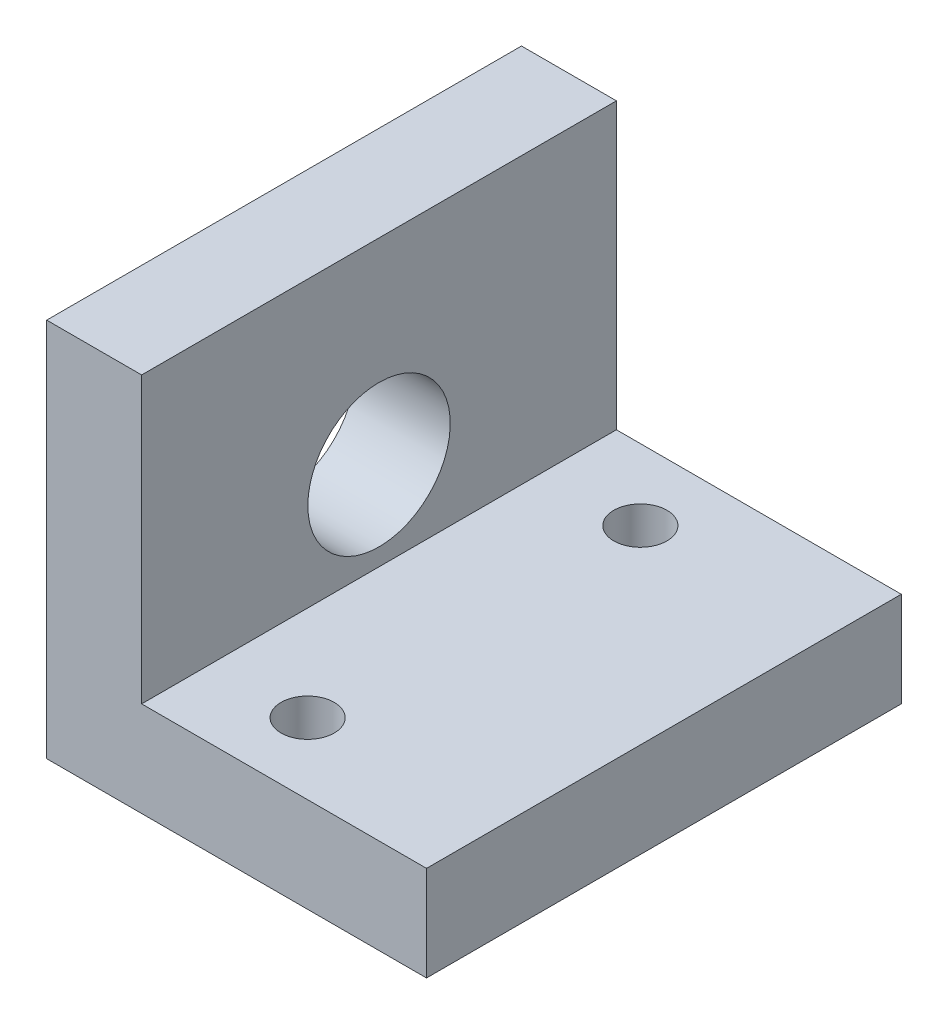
from build123d import *

# Parameters (mm, degrees)
BOSS_EXTRUDE1_DEPTH = 31.75
SKETCH2_R           = 4.7625
CUT_EXTRUDE1_DEPTH  = 48.941448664
SKETCH3_R           = 1.778
CUT_EXTRUDE2_DEPTH  = 45.901280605


with BuildPart() as part:
    # Sketch1 → Boss-Extrude1 (new body)
    with BuildSketch(Plane.XY):
        Polygon((0, 0), (0, 25.4), (6.35, 25.4), (6.35, 6.35), (25.4, 6.35), (25.4, 0), align=None)
    extrude(amount=-BOSS_EXTRUDE1_DEPTH)

    # Sketch2 → Cut-Extrude1 (cut, through all)
    with BuildSketch(Plane.ZY):
        with Locations((-15.875, 12.2682)):
            Circle(SKETCH2_R)
    extrude(amount=-CUT_EXTRUDE1_DEPTH, mode=Mode.SUBTRACT)

    # Sketch3 → Cut-Extrude2 (cut, through all)
    with BuildSketch(Plane(origin=(0, 6.35, 0), x_dir=(1, 0, 0), z_dir=(0, 1, 0))):
        with Locations(Location((12.7, 27.0002, 0), (0, 0, 270))):
            Circle(SKETCH3_R)
        with Locations(Location((12.7, 4.7498, 0), (0, 0, 270))):
            Circle(SKETCH3_R)
    extrude(amount=-CUT_EXTRUDE2_DEPTH, mode=Mode.SUBTRACT)


solid = part.part
